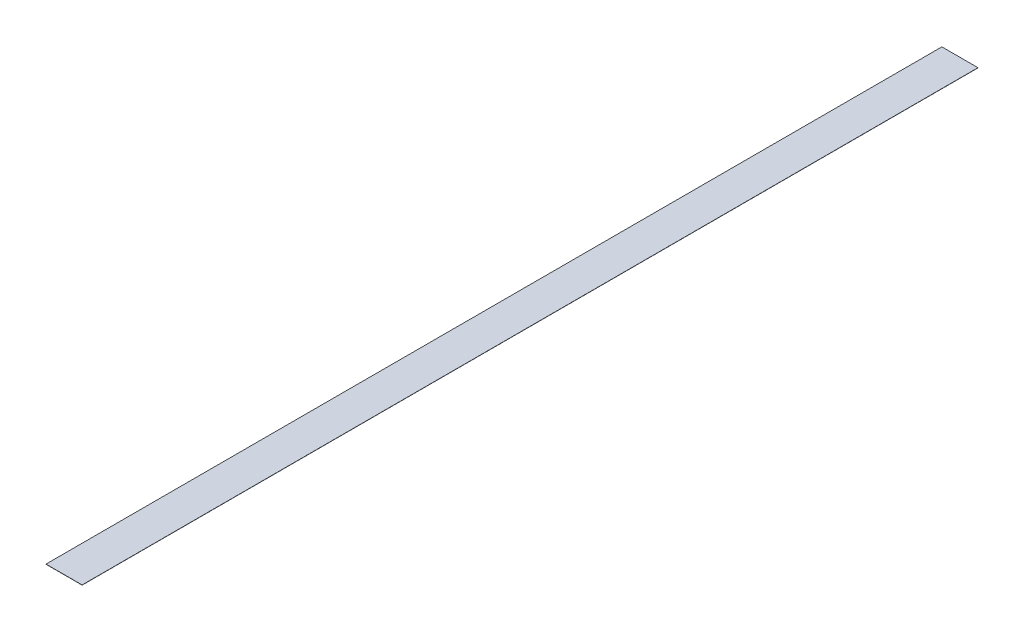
ISO-10303-21;
HEADER;
FILE_DESCRIPTION(('STEP AP214'),'2;1');
FILE_NAME('part.step','',(''),(''),'','','');
FILE_SCHEMA(('AUTOMOTIVE_DESIGN { 1 0 10303 214 1 1 1 1 }'));
ENDSEC;
DATA;
#1=APPLICATION_CONTEXT('core data for automotive mechanical design processes');
#2=APPLICATION_PROTOCOL_DEFINITION('international standard','automotive_design',2000,#1);
#3=PRODUCT_CONTEXT('',#1,'mechanical');
#4=PRODUCT('Part','Part','',(#3));
#5=PRODUCT_RELATED_PRODUCT_CATEGORY('part','',(#4));
#6=PRODUCT_DEFINITION_FORMATION('','',#4);
#7=PRODUCT_DEFINITION_CONTEXT('part definition',#1,'design');
#8=PRODUCT_DEFINITION('design','',#6,#7);
#9=PRODUCT_DEFINITION_SHAPE('','',#8);
#10=(LENGTH_UNIT() NAMED_UNIT(*) SI_UNIT(.MILLI.,.METRE.));
#11=(NAMED_UNIT(*) PLANE_ANGLE_UNIT() SI_UNIT($,.RADIAN.));
#12=(NAMED_UNIT(*) SI_UNIT($,.STERADIAN.) SOLID_ANGLE_UNIT());
#13=UNCERTAINTY_MEASURE_WITH_UNIT(LENGTH_MEASURE(1.E-05),#10,'distance_accuracy_value','');
#14=(GEOMETRIC_REPRESENTATION_CONTEXT(3) GLOBAL_UNCERTAINTY_ASSIGNED_CONTEXT((#13)) GLOBAL_UNIT_ASSIGNED_CONTEXT((#10,
#11,#12)) REPRESENTATION_CONTEXT('',''));
#15=CARTESIAN_POINT('',(0.,0.,0.));
#16=DIRECTION('',(0.,0.,1.));
#17=DIRECTION('',(1.,0.,0.));
#18=AXIS2_PLACEMENT_3D('',#15,#16,#17);
#19=CARTESIAN_POINT('',(23.8125,0.254,590.55));
#20=DIRECTION('',(-1.,0.,0.));
#21=DIRECTION('',(0.,0.,1.));
#22=AXIS2_PLACEMENT_3D('',#19,#20,#21);
#23=PLANE('',#22);
#24=DIRECTION('',(0.,0.,-1.));
#25=VECTOR('',#24,1.);
#26=CARTESIAN_POINT('',(23.8125,0.,590.55));
#27=LINE('',#26,#25);
#28=CARTESIAN_POINT('',(23.8125,0.,590.55));
#29=VERTEX_POINT('',#28);
#30=CARTESIAN_POINT('',(23.8125,0.,-590.55));
#31=VERTEX_POINT('',#30);
#32=EDGE_CURVE('E111',#29,#31,#27,.T.);
#33=ORIENTED_EDGE('',*,*,#32,.T.);
#34=DIRECTION('',(0.,-1.,0.));
#35=VECTOR('',#34,1.);
#36=CARTESIAN_POINT('',(23.8125,0.254,-590.55));
#37=LINE('',#36,#35);
#38=CARTESIAN_POINT('',(23.8125,0.254,-590.55));
#39=VERTEX_POINT('',#38);
#40=EDGE_CURVE('E11',#39,#31,#37,.T.);
#41=ORIENTED_EDGE('',*,*,#40,.F.);
#42=DIRECTION('',(0.,0.,-1.));
#43=VECTOR('',#42,1.);
#44=CARTESIAN_POINT('',(23.8125,0.254,590.55));
#45=LINE('',#44,#43);
#46=CARTESIAN_POINT('',(23.8125,0.254,590.55));
#47=VERTEX_POINT('',#46);
#48=EDGE_CURVE('E95',#47,#39,#45,.T.);
#49=ORIENTED_EDGE('',*,*,#48,.F.);
#50=DIRECTION('',(0.,-1.,0.));
#51=VECTOR('',#50,1.);
#52=CARTESIAN_POINT('',(23.8125,0.254,590.55));
#53=LINE('',#52,#51);
#54=EDGE_CURVE('E107',#47,#29,#53,.T.);
#55=ORIENTED_EDGE('',*,*,#54,.T.);
#56=EDGE_LOOP('',(#33,#41,#49,#55));
#57=FACE_BOUND('',#56,.T.);
#58=ADVANCED_FACE('F43',(#57),#23,.F.);
#59=CARTESIAN_POINT('',(23.8125,0.254,-590.55));
#60=DIRECTION('',(0.,0.,1.));
#61=DIRECTION('',(1.,0.,0.));
#62=AXIS2_PLACEMENT_3D('',#59,#60,#61);
#63=PLANE('',#62);
#64=DIRECTION('',(-1.,0.,0.));
#65=VECTOR('',#64,1.);
#66=CARTESIAN_POINT('',(23.8125,0.,-590.55));
#67=LINE('',#66,#65);
#68=CARTESIAN_POINT('',(-23.8125,0.,-590.55));
#69=VERTEX_POINT('',#68);
#70=EDGE_CURVE('E100',#31,#69,#67,.T.);
#71=ORIENTED_EDGE('',*,*,#70,.T.);
#72=DIRECTION('',(0.,-1.,0.));
#73=VECTOR('',#72,1.);
#74=CARTESIAN_POINT('',(-23.8125,0.254,-590.55));
#75=LINE('',#74,#73);
#76=CARTESIAN_POINT('',(-23.8125,0.254,-590.55));
#77=VERTEX_POINT('',#76);
#78=EDGE_CURVE('E52',#77,#69,#75,.T.);
#79=ORIENTED_EDGE('',*,*,#78,.F.);
#80=DIRECTION('',(-1.,0.,0.));
#81=VECTOR('',#80,1.);
#82=CARTESIAN_POINT('',(23.8125,0.254,-590.55));
#83=LINE('',#82,#81);
#84=EDGE_CURVE('E90',#39,#77,#83,.T.);
#85=ORIENTED_EDGE('',*,*,#84,.F.);
#86=ORIENTED_EDGE('',*,*,#40,.T.);
#87=EDGE_LOOP('',(#71,#79,#85,#86));
#88=FACE_BOUND('',#87,.T.);
#89=ADVANCED_FACE('F99',(#88),#63,.F.);
#90=CARTESIAN_POINT('',(-23.8125,0.254,590.55));
#91=DIRECTION('',(1.,0.,0.));
#92=DIRECTION('',(0.,0.,-1.));
#93=AXIS2_PLACEMENT_3D('',#90,#91,#92);
#94=PLANE('',#93);
#95=DIRECTION('',(0.,0.,1.));
#96=VECTOR('',#95,1.);
#97=CARTESIAN_POINT('',(-23.8125,0.,590.55));
#98=LINE('',#97,#96);
#99=CARTESIAN_POINT('',(-23.8125,0.,590.55));
#100=VERTEX_POINT('',#99);
#101=EDGE_CURVE('E77',#69,#100,#98,.T.);
#102=ORIENTED_EDGE('',*,*,#101,.T.);
#103=DIRECTION('',(0.,-1.,0.));
#104=VECTOR('',#103,1.);
#105=CARTESIAN_POINT('',(-23.8125,0.254,590.55));
#106=LINE('',#105,#104);
#107=CARTESIAN_POINT('',(-23.8125,0.254,590.55));
#108=VERTEX_POINT('',#107);
#109=EDGE_CURVE('E102',#108,#100,#106,.T.);
#110=ORIENTED_EDGE('',*,*,#109,.F.);
#111=DIRECTION('',(0.,0.,1.));
#112=VECTOR('',#111,1.);
#113=CARTESIAN_POINT('',(-23.8125,0.254,590.55));
#114=LINE('',#113,#112);
#115=EDGE_CURVE('E93',#77,#108,#114,.T.);
#116=ORIENTED_EDGE('',*,*,#115,.F.);
#117=ORIENTED_EDGE('',*,*,#78,.T.);
#118=EDGE_LOOP('',(#102,#110,#116,#117));
#119=FACE_BOUND('',#118,.T.);
#120=ADVANCED_FACE('F103',(#119),#94,.F.);
#121=CARTESIAN_POINT('',(23.8125,0.254,590.55));
#122=DIRECTION('',(0.,0.,-1.));
#123=DIRECTION('',(-1.,0.,0.));
#124=AXIS2_PLACEMENT_3D('',#121,#122,#123);
#125=PLANE('',#124);
#126=DIRECTION('',(1.,0.,0.));
#127=VECTOR('',#126,1.);
#128=CARTESIAN_POINT('',(23.8125,0.,590.55));
#129=LINE('',#128,#127);
#130=EDGE_CURVE('E83',#100,#29,#129,.T.);
#131=ORIENTED_EDGE('',*,*,#130,.T.);
#132=ORIENTED_EDGE('',*,*,#54,.F.);
#133=DIRECTION('',(1.,0.,0.));
#134=VECTOR('',#133,1.);
#135=CARTESIAN_POINT('',(23.8125,0.254,590.55));
#136=LINE('',#135,#134);
#137=EDGE_CURVE('E60',#108,#47,#136,.T.);
#138=ORIENTED_EDGE('',*,*,#137,.F.);
#139=ORIENTED_EDGE('',*,*,#109,.T.);
#140=EDGE_LOOP('',(#131,#132,#138,#139));
#141=FACE_BOUND('',#140,.T.);
#142=ADVANCED_FACE('F124',(#141),#125,.F.);
#143=CARTESIAN_POINT('',(0.,0.254,0.));
#144=DIRECTION('',(0.,1.,0.));
#145=DIRECTION('',(0.,0.,1.));
#146=AXIS2_PLACEMENT_3D('',#143,#144,#145);
#147=PLANE('',#146);
#148=ORIENTED_EDGE('',*,*,#48,.T.);
#149=ORIENTED_EDGE('',*,*,#84,.T.);
#150=ORIENTED_EDGE('',*,*,#115,.T.);
#151=ORIENTED_EDGE('',*,*,#137,.T.);
#152=EDGE_LOOP('',(#148,#149,#150,#151));
#153=FACE_BOUND('',#152,.T.);
#154=ADVANCED_FACE('F91',(#153),#147,.T.);
#155=CARTESIAN_POINT('',(0.,0.,0.));
#156=DIRECTION('',(0.,1.,0.));
#157=DIRECTION('',(0.,0.,1.));
#158=AXIS2_PLACEMENT_3D('',#155,#156,#157);
#159=PLANE('',#158);
#160=ORIENTED_EDGE('',*,*,#32,.F.);
#161=ORIENTED_EDGE('',*,*,#130,.F.);
#162=ORIENTED_EDGE('',*,*,#101,.F.);
#163=ORIENTED_EDGE('',*,*,#70,.F.);
#164=EDGE_LOOP('',(#160,#161,#162,#163));
#165=FACE_BOUND('',#164,.T.);
#166=ADVANCED_FACE('F127',(#165),#159,.F.);
#167=CLOSED_SHELL('',(#58,#89,#120,#142,#154,#166));
#168=MANIFOLD_SOLID_BREP('B2',#167);
#169=ADVANCED_BREP_SHAPE_REPRESENTATION('',(#18,#168),#14);
#170=SHAPE_DEFINITION_REPRESENTATION(#9,#169);
ENDSEC;
END-ISO-10303-21;
